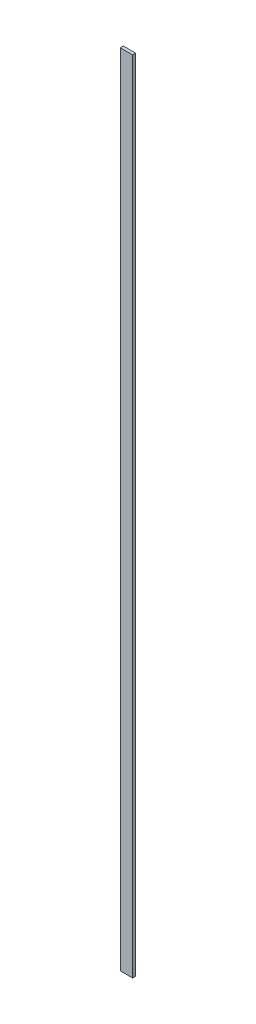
from build123d import *

# Parameters (mm, degrees)
SKICA1_W       = 20
SKICA1_H       = 1300
EXTRUDE1_DEPTH = 5


with BuildPart() as part:
    # Skica1 → Extrude1 (new body)
    with BuildSketch(Plane.XY):
        Rectangle(SKICA1_W, SKICA1_H)
    extrude(amount=EXTRUDE1_DEPTH)


solid = part.part
